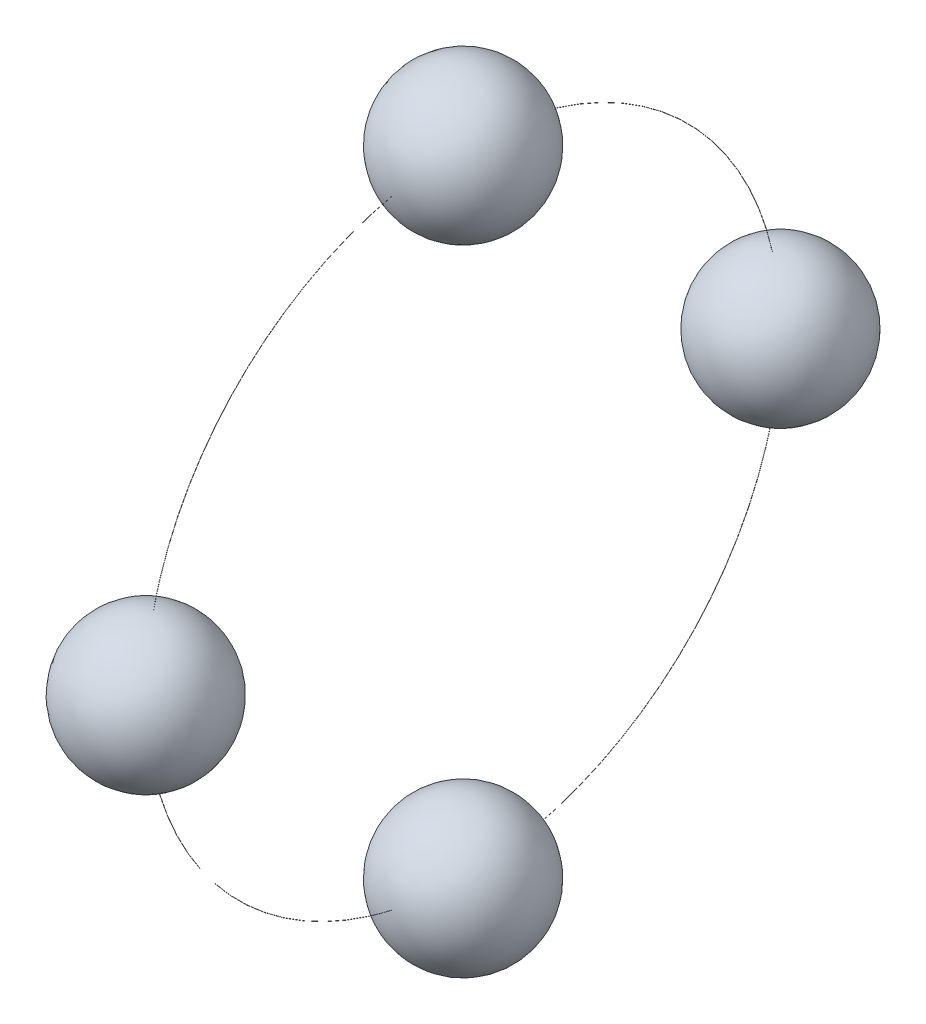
ISO-10303-21;
HEADER;
FILE_DESCRIPTION(('STEP AP214'),'2;1');
FILE_NAME('part.step','',(''),(''),'','','');
FILE_SCHEMA(('AUTOMOTIVE_DESIGN { 1 0 10303 214 1 1 1 1 }'));
ENDSEC;
DATA;
#1=APPLICATION_CONTEXT('core data for automotive mechanical design processes');
#2=APPLICATION_PROTOCOL_DEFINITION('international standard','automotive_design',2000,#1);
#3=PRODUCT_CONTEXT('',#1,'mechanical');
#4=PRODUCT('Part','Part','',(#3));
#5=PRODUCT_RELATED_PRODUCT_CATEGORY('part','',(#4));
#6=PRODUCT_DEFINITION_FORMATION('','',#4);
#7=PRODUCT_DEFINITION_CONTEXT('part definition',#1,'design');
#8=PRODUCT_DEFINITION('design','',#6,#7);
#9=PRODUCT_DEFINITION_SHAPE('','',#8);
#10=(LENGTH_UNIT() NAMED_UNIT(*) SI_UNIT(.MILLI.,.METRE.));
#11=(NAMED_UNIT(*) PLANE_ANGLE_UNIT() SI_UNIT($,.RADIAN.));
#12=(NAMED_UNIT(*) SI_UNIT($,.STERADIAN.) SOLID_ANGLE_UNIT());
#13=UNCERTAINTY_MEASURE_WITH_UNIT(LENGTH_MEASURE(1.E-05),#10,'distance_accuracy_value','');
#14=(GEOMETRIC_REPRESENTATION_CONTEXT(3) GLOBAL_UNCERTAINTY_ASSIGNED_CONTEXT((#13)) GLOBAL_UNIT_ASSIGNED_CONTEXT((#10,
#11,#12)) REPRESENTATION_CONTEXT('',''));
#15=CARTESIAN_POINT('',(0.,0.,0.));
#16=DIRECTION('',(0.,0.,1.));
#17=DIRECTION('',(1.,0.,0.));
#18=AXIS2_PLACEMENT_3D('',#15,#16,#17);
#19=CARTESIAN_POINT('',(1.5,0.,0.));
#20=DIRECTION('',(1.,0.,0.));
#21=DIRECTION('',(0.,-1.,0.));
#22=AXIS2_PLACEMENT_3D('',#19,#20,#21);
#23=TOROIDAL_SURFACE('',#22,3.75,0.001);
#24=CARTESIAN_POINT('',(1.4995848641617,-0.828274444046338,-3.6583173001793));
#25=CARTESIAN_POINT('',(1.49953374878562,-0.828271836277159,-3.658293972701));
#26=CARTESIAN_POINT('',(1.49948458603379,-0.82826874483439,-3.65826631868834));
#27=CARTESIAN_POINT('',(1.49939159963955,-0.828261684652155,-3.65820316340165));
#28=CARTESIAN_POINT('',(1.49934778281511,-0.828257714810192,-3.65816765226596));
#29=CARTESIAN_POINT('',(1.49926679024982,-0.828249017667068,-3.65808985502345));
#30=CARTESIAN_POINT('',(1.49922960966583,-0.828244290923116,-3.65804757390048));
#31=CARTESIAN_POINT('',(1.49916289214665,-0.828234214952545,-3.65795744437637));
#32=CARTESIAN_POINT('',(1.49913335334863,-0.828228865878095,-3.65790959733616));
#33=CARTESIAN_POINT('',(1.49908259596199,-0.828217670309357,-3.65780945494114));
#34=CARTESIAN_POINT('',(1.49906141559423,-0.828211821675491,-3.65775714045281));
#35=CARTESIAN_POINT('',(1.49902814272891,-0.828199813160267,-3.65764972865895));
#36=CARTESIAN_POINT('',(1.49901605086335,-0.828193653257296,-3.65759463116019));
#37=CARTESIAN_POINT('',(1.49900124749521,-0.828181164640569,-3.65748292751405));
#38=CARTESIAN_POINT('',(1.49899858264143,-0.828174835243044,-3.65742631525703));
#39=CARTESIAN_POINT('',(1.4990028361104,-0.828162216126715,-3.6573134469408));
#40=CARTESIAN_POINT('',(1.4990097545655,-0.828155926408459,-3.65725719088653));
#41=CARTESIAN_POINT('',(1.49903300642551,-0.828143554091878,-3.65714653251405));
#42=CARTESIAN_POINT('',(1.49904935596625,-0.828137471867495,-3.65709213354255));
#43=CARTESIAN_POINT('',(1.49909103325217,-0.82812569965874,-3.65698684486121));
#44=CARTESIAN_POINT('',(1.49911636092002,-0.828120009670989,-3.65693595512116));
#45=CARTESIAN_POINT('',(1.49917522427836,-0.828109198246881,-3.6568392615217));
#46=CARTESIAN_POINT('',(1.49920874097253,-0.828104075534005,-3.65679344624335));
#47=CARTESIAN_POINT('',(1.49928307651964,-0.828094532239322,-3.65670809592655));
#48=CARTESIAN_POINT('',(1.49932389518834,-0.828090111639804,-3.65666856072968));
#49=CARTESIAN_POINT('',(1.49941144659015,-0.828082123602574,-3.65659712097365));
#50=CARTESIAN_POINT('',(1.49945814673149,-0.828078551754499,-3.65656517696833));
#51=CARTESIAN_POINT('',(1.49955630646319,-0.828072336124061,-3.65650958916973));
#52=CARTESIAN_POINT('',(1.49960776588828,-0.828069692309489,-3.65648594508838));
#53=CARTESIAN_POINT('',(1.49971365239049,-0.828065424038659,-3.65644777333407));
#54=CARTESIAN_POINT('',(1.49976805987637,-0.828063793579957,-3.65643319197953));
#55=CARTESIAN_POINT('',(1.4998785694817,-0.828061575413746,-3.65641335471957));
#56=CARTESIAN_POINT('',(1.49993467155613,-0.828060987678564,-3.65640809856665));
#57=CARTESIAN_POINT('',(1.50004673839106,-0.828060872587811,-3.65640706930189));
#58=CARTESIAN_POINT('',(1.50010270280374,-0.828061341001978,-3.65641125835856));
#59=CARTESIAN_POINT('',(1.50021312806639,-0.828063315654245,-3.65642891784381));
#60=CARTESIAN_POINT('',(1.50026758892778,-0.828064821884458,-3.65644238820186));
#61=CARTESIAN_POINT('',(1.5003734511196,-0.828068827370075,-3.65647820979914));
#62=CARTESIAN_POINT('',(1.50042485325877,-0.828071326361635,-3.65650055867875));
#63=CARTESIAN_POINT('',(1.50052317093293,-0.828077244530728,-3.65655348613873));
#64=CARTESIAN_POINT('',(1.500570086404,-0.828080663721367,-3.65658406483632));
#65=CARTESIAN_POINT('',(1.50065828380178,-0.828088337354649,-3.65665269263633));
#66=CARTESIAN_POINT('',(1.5006995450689,-0.828092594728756,-3.65669076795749));
#67=CARTESIAN_POINT('',(1.50077509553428,-0.828101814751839,-3.6567732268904));
#68=CARTESIAN_POINT('',(1.50080938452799,-0.828106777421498,-3.65681761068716));
#69=CARTESIAN_POINT('',(1.50087023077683,-0.828117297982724,-3.65691170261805));
#70=CARTESIAN_POINT('',(1.50089674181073,-0.828122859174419,-3.65696144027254));
#71=CARTESIAN_POINT('',(1.50094103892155,-0.828134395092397,-3.65706461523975));
#72=CARTESIAN_POINT('',(1.50095882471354,-0.828140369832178,-3.65711805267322));
#73=CARTESIAN_POINT('',(1.50098526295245,-0.82815259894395,-3.6572274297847));
#74=CARTESIAN_POINT('',(1.50099386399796,-0.828158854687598,-3.65728338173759));
#75=CARTESIAN_POINT('',(1.50100152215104,-0.828171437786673,-3.65739592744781));
#76=CARTESIAN_POINT('',(1.50100057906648,-0.828177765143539,-3.65745252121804));
#77=CARTESIAN_POINT('',(1.50098915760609,-0.828190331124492,-3.65756491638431));
#78=CARTESIAN_POINT('',(1.50097865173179,-0.82819656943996,-3.65762071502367));
#79=CARTESIAN_POINT('',(1.50094835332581,-0.828208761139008,-3.657729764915));
#80=CARTESIAN_POINT('',(1.50092856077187,-0.828214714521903,-3.65778301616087));
#81=CARTESIAN_POINT('',(1.5008802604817,-0.828226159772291,-3.6578853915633));
#82=CARTESIAN_POINT('',(1.50085176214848,-0.828231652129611,-3.65793452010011));
#83=CARTESIAN_POINT('',(1.50078683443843,-0.828242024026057,-3.65802729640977));
#84=CARTESIAN_POINT('',(1.5007504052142,-0.82824690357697,-3.65807094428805));
#85=CARTESIAN_POINT('',(1.50067082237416,-0.828255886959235,-3.65815130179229));
#86=CARTESIAN_POINT('',(1.50062770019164,-0.828259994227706,-3.65818804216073));
#87=CARTESIAN_POINT('',(1.50053583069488,-0.828267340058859,-3.65825375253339));
#88=CARTESIAN_POINT('',(1.5004870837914,-0.828270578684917,-3.65828272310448));
#89=CARTESIAN_POINT('',(1.50038567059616,-0.828276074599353,-3.65833188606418));
#90=CARTESIAN_POINT('',(1.5003330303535,-0.828278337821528,-3.65835213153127));
#91=CARTESIAN_POINT('',(1.50022505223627,-0.828281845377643,-3.65838350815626));
#92=CARTESIAN_POINT('',(1.50016971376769,-0.828283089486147,-3.65839463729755));
#93=CARTESIAN_POINT('',(1.50005819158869,-0.828284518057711,-3.65840741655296));
#94=CARTESIAN_POINT('',(1.50000201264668,-0.828284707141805,-3.6584091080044));
#95=CARTESIAN_POINT('',(1.49989021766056,-0.828284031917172,-3.65840306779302));
#96=CARTESIAN_POINT('',(1.49983460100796,-0.828283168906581,-3.65839534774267));
#97=CARTESIAN_POINT('',(1.49974649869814,-0.828280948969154,-3.65837548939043));
#98=CARTESIAN_POINT('',(1.49971333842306,-0.828279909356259,-3.6583661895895));
#99=CARTESIAN_POINT('',(1.49964816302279,-0.828277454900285,-3.65834423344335));
#100=CARTESIAN_POINT('',(1.49961614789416,-0.828276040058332,-3.65833157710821));
#101=CARTESIAN_POINT('',(1.4995848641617,-0.828274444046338,-3.6583173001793));
#102=B_SPLINE_CURVE_WITH_KNOTS('',3,(#24,#25,#26,#27,#28,#29,#30,#31,#32,#33,#34,#35,#36,#37,
#38,#39,#40,#41,#42,#43,#44,#45,#46,#47,#48,#49,#50,#51,#52,#53,#54,#55,#56,#57,#58,#59,#60,#61,
#62,#63,#64,#65,#66,#67,#68,#69,#70,#71,#72,#73,#74,#75,#76,#77,#78,#79,#80,#81,#82,#83,#84,#85,
#86,#87,#88,#89,#90,#91,#92,#93,#94,#95,#96,#97,#98,#99,#100,#101),.UNSPECIFIED.,.T.,.F.,(4,2,2,
2,2,2,2,2,2,2,2,2,2,2,2,2,2,2,2,2,2,2,2,2,2,2,2,2,2,2,2,2,2,2,2,2,2,2,4),(0.,
0.000168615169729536,0.000337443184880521,0.000506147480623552,0.000674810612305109,
0.000844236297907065,0.00101367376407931,0.00118394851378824,0.00135422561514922,
0.00152479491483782,0.00169536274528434,0.0018655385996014,0.00203571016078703,
0.00220497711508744,0.00237423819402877,0.00254248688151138,0.00271073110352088,
0.00287830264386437,0.00304587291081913,0.00321339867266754,0.00338092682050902,
0.00354905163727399,0.00371718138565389,0.00388629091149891,0.00405540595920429,
0.00422546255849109,0.00439552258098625,0.00456607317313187,0.00473662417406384,
0.00490699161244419,0.00507735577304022,0.0052469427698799,0.00541651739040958,
0.00558504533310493,0.0057536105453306,0.00592143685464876,0.00608905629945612,
0.00619225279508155,0.00629544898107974),.UNSPECIFIED.);
#103=CARTESIAN_POINT('',(1.4995848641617,-0.828274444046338,-3.6583173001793));
#104=VERTEX_POINT('',#103);
#105=EDGE_CURVE('E10',#104,#104,#102,.T.);
#106=ORIENTED_EDGE('',*,*,#105,.F.);
#107=EDGE_LOOP('',(#106));
#108=FACE_BOUND('',#107,.T.);
#109=CARTESIAN_POINT('',(1.4995848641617,-3.6583173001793,-0.828274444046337));
#110=CARTESIAN_POINT('',(1.49963564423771,-3.65834046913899,-0.828277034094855));
#111=CARTESIAN_POINT('',(1.4996884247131,-3.65835940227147,-0.82827915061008));
#112=CARTESIAN_POINT('',(1.49979647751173,-3.65838820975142,-0.828282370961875));
#113=CARTESIAN_POINT('',(1.49985175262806,-3.65839807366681,-0.828283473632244));
#114=CARTESIAN_POINT('',(1.49996316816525,-3.65840842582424,-0.828284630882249));
#115=CARTESIAN_POINT('',(1.50001930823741,-3.65840891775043,-0.828284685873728));
#116=CARTESIAN_POINT('',(1.50013085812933,-3.65840051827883,-0.828283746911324));
#117=CARTESIAN_POINT('',(1.50018626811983,-3.65839162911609,-0.828282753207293));
#118=CARTESIAN_POINT('',(1.50029476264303,-3.6583647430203,-0.828279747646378));
#119=CARTESIAN_POINT('',(1.50034784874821,-3.65834675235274,-0.828277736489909));
#120=CARTESIAN_POINT('',(1.5004502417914,-3.65830219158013,-0.828272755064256));
#121=CARTESIAN_POINT('',(1.50049954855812,-3.65827562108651,-0.828269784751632));
#122=CARTESIAN_POINT('',(1.50059312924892,-3.65821458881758,-0.828262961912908));
#123=CARTESIAN_POINT('',(1.50063738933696,-3.65818010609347,-0.828259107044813));
#124=CARTESIAN_POINT('',(1.50071949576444,-3.6581042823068,-0.828250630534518));
#125=CARTESIAN_POINT('',(1.50075734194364,-3.65806294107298,-0.828246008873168));
#126=CARTESIAN_POINT('',(1.50082577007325,-3.65797433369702,-0.828236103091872));
#127=CARTESIAN_POINT('',(1.50085631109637,-3.65792703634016,-0.828230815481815));
#128=CARTESIAN_POINT('',(1.50090902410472,-3.65782804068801,-0.828219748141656));
#129=CARTESIAN_POINT('',(1.50093119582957,-3.65777634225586,-0.828213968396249));
#130=CARTESIAN_POINT('',(1.5009666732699,-3.65766968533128,-0.828202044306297));
#131=CARTESIAN_POINT('',(1.50097992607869,-3.65761470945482,-0.82819589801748));
#132=CARTESIAN_POINT('',(1.50099699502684,-3.65750332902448,-0.828183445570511));
#133=CARTESIAN_POINT('',(1.50100081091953,-3.6574469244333,-0.828177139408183));
#134=CARTESIAN_POINT('',(1.50099889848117,-3.65733406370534,-0.828164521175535));
#135=CARTESIAN_POINT('',(1.50099313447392,-3.65727760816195,-0.828158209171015));
#136=CARTESIAN_POINT('',(1.50097215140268,-3.65716645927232,-0.828145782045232));
#137=CARTESIAN_POINT('',(1.50095693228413,-3.65711176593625,-0.828139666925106));
#138=CARTESIAN_POINT('',(1.50091745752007,-3.65700570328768,-0.828127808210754));
#139=CARTESIAN_POINT('',(1.50089320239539,-3.65695433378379,-0.828122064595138));
#140=CARTESIAN_POINT('',(1.50083632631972,-3.65685639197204,-0.82811111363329));
#141=CARTESIAN_POINT('',(1.50080370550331,-3.65680981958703,-0.828105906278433));
#142=CARTESIAN_POINT('',(1.50073115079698,-3.65672299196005,-0.828096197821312));
#143=CARTESIAN_POINT('',(1.50069124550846,-3.65668271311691,-0.82809169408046));
#144=CARTESIAN_POINT('',(1.50060516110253,-3.65660943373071,-0.828083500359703));
#145=CARTESIAN_POINT('',(1.50055898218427,-3.65657643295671,-0.828079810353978));
#146=CARTESIAN_POINT('',(1.50046195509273,-3.65651885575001,-0.828073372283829));
#147=CARTESIAN_POINT('',(1.50041113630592,-3.65649423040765,-0.828070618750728));
#148=CARTESIAN_POINT('',(1.50030604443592,-3.65645386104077,-0.828066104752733));
#149=CARTESIAN_POINT('',(1.50025177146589,-3.65643811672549,-0.828064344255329));
#150=CARTESIAN_POINT('',(1.5001416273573,-3.65641603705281,-0.828061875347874));
#151=CARTESIAN_POINT('',(1.50008576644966,-3.65640965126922,-0.828061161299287));
#152=CARTESIAN_POINT('',(1.49997376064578,-3.65640631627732,-0.82806078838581));
#153=CARTESIAN_POINT('',(1.49991761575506,-3.65640936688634,-0.828061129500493));
#154=CARTESIAN_POINT('',(1.49980678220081,-3.65642479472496,-0.828062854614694));
#155=CARTESIAN_POINT('',(1.49975209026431,-3.65643714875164,-0.828064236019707));
#156=CARTESIAN_POINT('',(1.49964556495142,-3.65647079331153,-0.828067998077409));
#157=CARTESIAN_POINT('',(1.49959373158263,-3.65649208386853,-0.82807037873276));
#158=CARTESIAN_POINT('',(1.49949430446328,-3.65654301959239,-0.828076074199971));
#159=CARTESIAN_POINT('',(1.49944671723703,-3.65657267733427,-0.828079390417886));
#160=CARTESIAN_POINT('',(1.49935719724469,-3.65663947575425,-0.828086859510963));
#161=CARTESIAN_POINT('',(1.49931526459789,-3.65667661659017,-0.828091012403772));
#162=CARTESIAN_POINT('',(1.49923802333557,-3.65675751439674,-0.828100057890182));
#163=CARTESIAN_POINT('',(1.49920274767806,-3.65680130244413,-0.828104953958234));
#164=CARTESIAN_POINT('',(1.49914004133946,-3.65689411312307,-0.828115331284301));
#165=CARTESIAN_POINT('',(1.49911261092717,-3.65694313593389,-0.828120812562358));
#166=CARTESIAN_POINT('',(1.4990662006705,-3.6570453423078,-0.828132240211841));
#167=CARTESIAN_POINT('',(1.49904727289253,-3.65709854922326,-0.828138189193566));
#168=CARTESIAN_POINT('',(1.49901862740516,-3.65720735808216,-0.828150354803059));
#169=CARTESIAN_POINT('',(1.49900890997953,-3.65726296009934,-0.828156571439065));
#170=CARTESIAN_POINT('',(1.49899892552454,-3.65737525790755,-0.828169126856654));
#171=CARTESIAN_POINT('',(1.49899870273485,-3.65743195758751,-0.828175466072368));
#172=CARTESIAN_POINT('',(1.49900782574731,-3.65754459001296,-0.828188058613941));
#173=CARTESIAN_POINT('',(1.49901717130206,-3.65760052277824,-0.828194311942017));
#174=CARTESIAN_POINT('',(1.49904519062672,-3.65771009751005,-0.828206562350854));
#175=CARTESIAN_POINT('',(1.49906387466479,-3.65776373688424,-0.828212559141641));
#176=CARTESIAN_POINT('',(1.49911006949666,-3.65786713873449,-0.828224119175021));
#177=CARTESIAN_POINT('',(1.49913758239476,-3.65791690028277,-0.828229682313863));
#178=CARTESIAN_POINT('',(1.49920058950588,-3.65801098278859,-0.828240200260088));
#179=CARTESIAN_POINT('',(1.49923606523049,-3.65805531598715,-0.828245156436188));
#180=CARTESIAN_POINT('',(1.49931401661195,-3.65813734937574,-0.828254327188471));
#181=CARTESIAN_POINT('',(1.4993564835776,-3.65817505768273,-0.828258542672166));
#182=CARTESIAN_POINT('',(1.49943027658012,-3.65823014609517,-0.828264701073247));
#183=CARTESIAN_POINT('',(1.49945986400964,-3.65824986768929,-0.828266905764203));
#184=CARTESIAN_POINT('',(1.49952098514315,-3.65828606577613,-0.828270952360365));
#185=CARTESIAN_POINT('',(1.49955251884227,-3.65830254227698,-0.828272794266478));
#186=CARTESIAN_POINT('',(1.4995848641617,-3.6583173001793,-0.828274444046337));
#187=B_SPLINE_CURVE_WITH_KNOTS('',3,(#109,#110,#111,#112,#113,#114,#115,#116,#117,#118,#119,
#120,#121,#122,#123,#124,#125,#126,#127,#128,#129,#130,#131,#132,#133,#134,#135,#136,#137,#138,
#139,#140,#141,#142,#143,#144,#145,#146,#147,#148,#149,#150,#151,#152,#153,#154,#155,#156,#157,
#158,#159,#160,#161,#162,#163,#164,#165,#166,#167,#168,#169,#170,#171,#172,#173,#174,#175,#176,
#177,#178,#179,#180,#181,#182,#183,#184,#185,#186),.UNSPECIFIED.,.T.,.F.,(4,2,2,2,2,2,2,2,2,2,2,
2,2,2,2,2,2,2,2,2,2,2,2,2,2,2,2,2,2,2,2,2,2,2,2,2,2,2,4),(0.,0.000167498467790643,
0.000335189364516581,0.000502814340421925,0.000670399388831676,0.000837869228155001,
0.00100534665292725,0.00117327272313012,0.00134120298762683,0.00151005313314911,
0.00167890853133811,0.00184875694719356,0.00201860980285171,0.00218909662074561,
0.0023595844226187,0.00253006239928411,0.00270053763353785,0.00287035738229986,
0.00304017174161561,0.00320897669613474,0.00337777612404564,0.00354566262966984,
0.00371354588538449,0.00388101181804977,0.00404847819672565,0.0042161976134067,
0.0043839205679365,0.00455245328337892,0.00472099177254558,0.00489054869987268,
0.00506011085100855,0.00523046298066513,0.00540081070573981,0.00557134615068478,
0.00574192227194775,0.00591210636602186,0.00608208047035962,0.0061887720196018,
0.00629546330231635),.UNSPECIFIED.);
#188=CARTESIAN_POINT('',(1.4995848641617,-3.6583173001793,-0.828274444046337));
#189=VERTEX_POINT('',#188);
#190=EDGE_CURVE('E35',#189,#189,#187,.T.);
#191=ORIENTED_EDGE('',*,*,#190,.F.);
#192=EDGE_LOOP('',(#191));
#193=FACE_BOUND('',#192,.T.);
#194=ADVANCED_FACE('F14',(#108,#193),#23,.T.);
#195=CARTESIAN_POINT('',(1.4995848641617,0.828274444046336,-3.6583173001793));
#196=CARTESIAN_POINT('',(1.49963564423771,0.828277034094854,-3.65834046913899));
#197=CARTESIAN_POINT('',(1.4996884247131,0.82827915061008,-3.65835940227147));
#198=CARTESIAN_POINT('',(1.49979647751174,0.828282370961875,-3.65838820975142));
#199=CARTESIAN_POINT('',(1.49985175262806,0.828283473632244,-3.65839807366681));
#200=CARTESIAN_POINT('',(1.49996316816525,0.828284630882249,-3.65840842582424));
#201=CARTESIAN_POINT('',(1.50001930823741,0.828284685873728,-3.65840891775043));
#202=CARTESIAN_POINT('',(1.50013085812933,0.828283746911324,-3.65840051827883));
#203=CARTESIAN_POINT('',(1.50018626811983,0.828282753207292,-3.65839162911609));
#204=CARTESIAN_POINT('',(1.50029476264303,0.828279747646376,-3.6583647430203));
#205=CARTESIAN_POINT('',(1.50034784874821,0.828277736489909,-3.65834675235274));
#206=CARTESIAN_POINT('',(1.5004502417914,0.828272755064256,-3.65830219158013));
#207=CARTESIAN_POINT('',(1.50049954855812,0.828269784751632,-3.65827562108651));
#208=CARTESIAN_POINT('',(1.50059312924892,0.828262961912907,-3.65821458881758));
#209=CARTESIAN_POINT('',(1.50063738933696,0.828259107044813,-3.65818010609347));
#210=CARTESIAN_POINT('',(1.50071949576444,0.828250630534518,-3.6581042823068));
#211=CARTESIAN_POINT('',(1.50075734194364,0.828246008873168,-3.65806294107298));
#212=CARTESIAN_POINT('',(1.50082577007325,0.828236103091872,-3.65797433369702));
#213=CARTESIAN_POINT('',(1.50085631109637,0.828230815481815,-3.65792703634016));
#214=CARTESIAN_POINT('',(1.50090902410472,0.828219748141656,-3.65782804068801));
#215=CARTESIAN_POINT('',(1.50093119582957,0.828213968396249,-3.65777634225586));
#216=CARTESIAN_POINT('',(1.5009666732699,0.828202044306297,-3.65766968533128));
#217=CARTESIAN_POINT('',(1.50097992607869,0.82819589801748,-3.65761470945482));
#218=CARTESIAN_POINT('',(1.50099699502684,0.82818344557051,-3.65750332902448));
#219=CARTESIAN_POINT('',(1.50100081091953,0.828177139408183,-3.65744692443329));
#220=CARTESIAN_POINT('',(1.50099889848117,0.828164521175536,-3.65733406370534));
#221=CARTESIAN_POINT('',(1.50099313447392,0.828158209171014,-3.65727760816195));
#222=CARTESIAN_POINT('',(1.50097215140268,0.828145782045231,-3.65716645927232));
#223=CARTESIAN_POINT('',(1.50095693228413,0.828139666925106,-3.65711176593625));
#224=CARTESIAN_POINT('',(1.50091745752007,0.828127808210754,-3.65700570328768));
#225=CARTESIAN_POINT('',(1.50089320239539,0.828122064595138,-3.65695433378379));
#226=CARTESIAN_POINT('',(1.50083632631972,0.828111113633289,-3.65685639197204));
#227=CARTESIAN_POINT('',(1.50080370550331,0.828105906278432,-3.65680981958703));
#228=CARTESIAN_POINT('',(1.50073115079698,0.828096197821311,-3.65672299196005));
#229=CARTESIAN_POINT('',(1.50069124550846,0.828091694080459,-3.65668271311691));
#230=CARTESIAN_POINT('',(1.50060516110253,0.828083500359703,-3.65660943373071));
#231=CARTESIAN_POINT('',(1.50055898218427,0.828079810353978,-3.65657643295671));
#232=CARTESIAN_POINT('',(1.50046195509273,0.828073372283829,-3.65651885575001));
#233=CARTESIAN_POINT('',(1.50041113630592,0.828070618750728,-3.65649423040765));
#234=CARTESIAN_POINT('',(1.50030604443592,0.828066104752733,-3.65645386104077));
#235=CARTESIAN_POINT('',(1.50025177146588,0.828064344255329,-3.65643811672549));
#236=CARTESIAN_POINT('',(1.5001416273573,0.828061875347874,-3.65641603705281));
#237=CARTESIAN_POINT('',(1.50008576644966,0.828061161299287,-3.65640965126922));
#238=CARTESIAN_POINT('',(1.49997376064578,0.828060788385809,-3.65640631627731));
#239=CARTESIAN_POINT('',(1.49991761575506,0.828061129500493,-3.65640936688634));
#240=CARTESIAN_POINT('',(1.49980678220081,0.828062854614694,-3.65642479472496));
#241=CARTESIAN_POINT('',(1.49975209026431,0.828064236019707,-3.65643714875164));
#242=CARTESIAN_POINT('',(1.49964556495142,0.828067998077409,-3.65647079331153));
#243=CARTESIAN_POINT('',(1.49959373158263,0.82807037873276,-3.65649208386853));
#244=CARTESIAN_POINT('',(1.49949430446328,0.828076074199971,-3.65654301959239));
#245=CARTESIAN_POINT('',(1.49944671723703,0.828079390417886,-3.65657267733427));
#246=CARTESIAN_POINT('',(1.49935719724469,0.828086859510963,-3.65663947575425));
#247=CARTESIAN_POINT('',(1.49931526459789,0.828091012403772,-3.65667661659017));
#248=CARTESIAN_POINT('',(1.49923802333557,0.828100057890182,-3.65675751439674));
#249=CARTESIAN_POINT('',(1.49920274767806,0.828104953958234,-3.65680130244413));
#250=CARTESIAN_POINT('',(1.49914004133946,0.828115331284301,-3.65689411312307));
#251=CARTESIAN_POINT('',(1.49911261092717,0.828120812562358,-3.65694313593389));
#252=CARTESIAN_POINT('',(1.4990662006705,0.828132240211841,-3.6570453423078));
#253=CARTESIAN_POINT('',(1.49904727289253,0.828138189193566,-3.65709854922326));
#254=CARTESIAN_POINT('',(1.49901862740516,0.828150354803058,-3.65720735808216));
#255=CARTESIAN_POINT('',(1.49900890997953,0.828156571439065,-3.65726296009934));
#256=CARTESIAN_POINT('',(1.49899892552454,0.828169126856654,-3.65737525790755));
#257=CARTESIAN_POINT('',(1.49899870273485,0.828175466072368,-3.65743195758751));
#258=CARTESIAN_POINT('',(1.49900782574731,0.828188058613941,-3.65754459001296));
#259=CARTESIAN_POINT('',(1.49901717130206,0.828194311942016,-3.65760052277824));
#260=CARTESIAN_POINT('',(1.49904519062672,0.828206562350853,-3.65771009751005));
#261=CARTESIAN_POINT('',(1.49906387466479,0.828212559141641,-3.65776373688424));
#262=CARTESIAN_POINT('',(1.49911006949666,0.828224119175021,-3.65786713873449));
#263=CARTESIAN_POINT('',(1.49913758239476,0.828229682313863,-3.65791690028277));
#264=CARTESIAN_POINT('',(1.49920058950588,0.828240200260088,-3.65801098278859));
#265=CARTESIAN_POINT('',(1.49923606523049,0.828245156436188,-3.65805531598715));
#266=CARTESIAN_POINT('',(1.49931401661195,0.828254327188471,-3.65813734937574));
#267=CARTESIAN_POINT('',(1.4993564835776,0.828258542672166,-3.65817505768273));
#268=CARTESIAN_POINT('',(1.49943027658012,0.828264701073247,-3.65823014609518));
#269=CARTESIAN_POINT('',(1.49945986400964,0.828266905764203,-3.65824986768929));
#270=CARTESIAN_POINT('',(1.49952098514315,0.828270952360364,-3.65828606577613));
#271=CARTESIAN_POINT('',(1.49955251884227,0.828272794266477,-3.65830254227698));
#272=CARTESIAN_POINT('',(1.4995848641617,0.828274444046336,-3.6583173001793));
#273=B_SPLINE_CURVE_WITH_KNOTS('',3,(#195,#196,#197,#198,#199,#200,#201,#202,#203,#204,#205,
#206,#207,#208,#209,#210,#211,#212,#213,#214,#215,#216,#217,#218,#219,#220,#221,#222,#223,#224,
#225,#226,#227,#228,#229,#230,#231,#232,#233,#234,#235,#236,#237,#238,#239,#240,#241,#242,#243,
#244,#245,#246,#247,#248,#249,#250,#251,#252,#253,#254,#255,#256,#257,#258,#259,#260,#261,#262,
#263,#264,#265,#266,#267,#268,#269,#270,#271,#272),.UNSPECIFIED.,.T.,.F.,(4,2,2,2,2,2,2,2,2,2,2,
2,2,2,2,2,2,2,2,2,2,2,2,2,2,2,2,2,2,2,2,2,2,2,2,2,2,2,4),(0.,0.00016749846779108,
0.000335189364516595,0.000502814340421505,0.0006703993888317,0.000837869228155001,
0.00100534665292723,0.00117327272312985,0.00134120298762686,0.00151005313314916,
0.00167890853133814,0.00184875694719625,0.0020186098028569,0.00218909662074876,
0.00235958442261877,0.00253006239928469,0.00270053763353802,0.00287035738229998,
0.00304017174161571,0.00320897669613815,0.00337777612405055,0.00354566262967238,
0.00371354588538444,0.00388101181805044,0.00404847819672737,0.00421619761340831,
0.00438392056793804,0.00455245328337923,0.0047209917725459,0.00489054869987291,
0.00506011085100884,0.00523046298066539,0.00540081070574,0.00557134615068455,
0.00574192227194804,0.00591210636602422,0.006082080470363,0.00618877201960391,
0.00629546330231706),.UNSPECIFIED.);
#274=CARTESIAN_POINT('',(1.4995848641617,0.828274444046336,-3.6583173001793));
#275=VERTEX_POINT('',#274);
#276=EDGE_CURVE('E26',#275,#275,#273,.T.);
#277=ORIENTED_EDGE('',*,*,#276,.F.);
#278=EDGE_LOOP('',(#277));
#279=FACE_BOUND('',#278,.T.);
#280=CARTESIAN_POINT('',(1.49964915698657,3.65647110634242,-0.828068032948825));
#281=CARTESIAN_POINT('',(1.49970142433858,3.65645152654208,-0.828065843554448));
#282=CARTESIAN_POINT('',(1.49975539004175,3.65643631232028,-0.828064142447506));
#283=CARTESIAN_POINT('',(1.49986516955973,3.65641509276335,-0.828061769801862));
#284=CARTESIAN_POINT('',(1.49992098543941,3.65640909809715,-0.82806109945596));
#285=CARTESIAN_POINT('',(1.50003281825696,3.65640651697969,-0.828060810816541));
#286=CARTESIAN_POINT('',(1.5000888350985,3.65640992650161,-0.828061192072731));
#287=CARTESIAN_POINT('',(1.50019948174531,3.65642604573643,-0.828062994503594));
#288=CARTESIAN_POINT('',(1.50025411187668,3.65643875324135,-0.828064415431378));
#289=CARTESIAN_POINT('',(1.5003604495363,3.65647309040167,-0.828068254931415));
#290=CARTESIAN_POINT('',(1.50041215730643,3.65649471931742,-0.828070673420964));
#291=CARTESIAN_POINT('',(1.50051120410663,3.65654626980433,-0.82807643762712));
#292=CARTESIAN_POINT('',(1.50055854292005,3.65657619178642,-0.828079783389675));
#293=CARTESIAN_POINT('',(1.50064768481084,3.65664357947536,-0.828087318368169));
#294=CARTESIAN_POINT('',(1.50068946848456,3.65668107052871,-0.828091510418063));
#295=CARTESIAN_POINT('',(1.50076615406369,3.65676245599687,-0.828100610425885));
#296=CARTESIAN_POINT('',(1.50080105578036,3.65680635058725,-0.828105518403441));
#297=CARTESIAN_POINT('',(1.5008632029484,3.65689956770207,-0.828115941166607));
#298=CARTESIAN_POINT('',(1.50089040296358,3.6569489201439,-0.828121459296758));
#299=CARTESIAN_POINT('',(1.50093613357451,3.65705144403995,-0.828132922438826));
#300=CARTESIAN_POINT('',(1.50095466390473,3.65710461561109,-0.828138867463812));
#301=CARTESIAN_POINT('',(1.50098263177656,3.65721359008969,-0.8281510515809));
#302=CARTESIAN_POINT('',(1.50099201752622,3.65726940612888,-0.828157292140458));
#303=CARTESIAN_POINT('',(1.50100125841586,3.65738181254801,-0.828169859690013));
#304=CARTESIAN_POINT('',(1.5010011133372,3.6574384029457,-0.82817618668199));
#305=CARTESIAN_POINT('',(1.5009912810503,3.65755093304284,-0.828188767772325));
#306=CARTESIAN_POINT('',(1.50098156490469,3.65760687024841,-0.828195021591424));
#307=CARTESIAN_POINT('',(1.50095281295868,3.65771632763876,-0.8282072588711));
#308=CARTESIAN_POINT('',(1.50093377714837,3.65776984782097,-0.828213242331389));
#309=CARTESIAN_POINT('',(1.50088693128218,3.65787289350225,-0.828224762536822));
#310=CARTESIAN_POINT('',(1.50085912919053,3.65792242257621,-0.828230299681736));
#311=CARTESIAN_POINT('',(1.50079551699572,3.65801611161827,-0.828240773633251));
#312=CARTESIAN_POINT('',(1.50075970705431,3.65806027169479,-0.828245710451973));
#313=CARTESIAN_POINT('',(1.50068126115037,3.65814175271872,-0.828254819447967));
#314=CARTESIAN_POINT('',(1.50063865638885,3.65817910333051,-0.828258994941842));
#315=CARTESIAN_POINT('',(1.50054770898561,3.65824611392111,-0.828266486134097));
#316=CARTESIAN_POINT('',(1.5004993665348,3.65827577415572,-0.828269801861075));
#317=CARTESIAN_POINT('',(1.5003986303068,3.65832637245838,-0.828275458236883));
#318=CARTESIAN_POINT('',(1.50034626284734,3.65834736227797,-0.828277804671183));
#319=CARTESIAN_POINT('',(1.50023871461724,3.65838025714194,-0.828281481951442));
#320=CARTESIAN_POINT('',(1.5001835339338,3.6583921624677,-0.828282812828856));
#321=CARTESIAN_POINT('',(1.50007221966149,3.6584064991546,-0.828284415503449));
#322=CARTESIAN_POINT('',(1.50001609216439,3.65840897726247,-0.828284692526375));
#323=CARTESIAN_POINT('',(1.49990421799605,3.65840451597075,-0.828284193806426));
#324=CARTESIAN_POINT('',(1.49984847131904,3.65839757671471,-0.828283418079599));
#325=CARTESIAN_POINT('',(1.49973903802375,3.65837450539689,-0.828280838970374));
#326=CARTESIAN_POINT('',(1.49968534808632,3.65835838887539,-0.82827903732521));
#327=CARTESIAN_POINT('',(1.49958144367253,3.65831744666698,-0.828274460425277));
#328=CARTESIAN_POINT('',(1.49953122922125,3.65829262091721,-0.82827168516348));
#329=CARTESIAN_POINT('',(1.49943557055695,3.65823491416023,-0.828265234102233));
#330=CARTESIAN_POINT('',(1.49939013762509,3.65820201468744,-0.828261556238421));
#331=CARTESIAN_POINT('',(1.4993054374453,3.65812913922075,-0.828253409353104));
#332=CARTESIAN_POINT('',(1.49926617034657,3.65808916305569,-0.828248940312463));
#333=CARTESIAN_POINT('',(1.49919469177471,3.65800304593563,-0.828239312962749));
#334=CARTESIAN_POINT('',(1.4991625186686,3.65795687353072,-0.828234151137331));
#335=CARTESIAN_POINT('',(1.49910637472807,3.65785984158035,-0.828223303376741));
#336=CARTESIAN_POINT('',(1.49908240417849,3.65780898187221,-0.828217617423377));
#337=CARTESIAN_POINT('',(1.49904319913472,3.65770369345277,-0.828205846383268));
#338=CARTESIAN_POINT('',(1.49902801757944,3.65764924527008,-0.828199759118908));
#339=CARTESIAN_POINT('',(1.49900702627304,3.6575385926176,-0.82818738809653));
#340=CARTESIAN_POINT('',(1.49900121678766,3.65748238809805,-0.828181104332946));
#341=CARTESIAN_POINT('',(1.4989991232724,3.65736957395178,-0.828168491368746));
#342=CARTESIAN_POINT('',(1.49900287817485,3.65731296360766,-0.828162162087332));
#343=CARTESIAN_POINT('',(1.49901989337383,3.65720117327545,-0.828149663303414));
#344=CARTESIAN_POINT('',(1.49903315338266,3.65714599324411,-0.828143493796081));
#345=CARTESIAN_POINT('',(1.49906881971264,3.65703861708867,-0.828131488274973));
#346=CARTESIAN_POINT('',(1.49909122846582,3.65698642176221,-0.828125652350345));
#347=CARTESIAN_POINT('',(1.49914458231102,3.65688651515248,-0.828114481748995));
#348=CARTESIAN_POINT('',(1.49917552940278,3.65683880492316,-0.828109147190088));
#349=CARTESIAN_POINT('',(1.49924498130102,3.6567494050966,-0.828099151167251));
#350=CARTESIAN_POINT('',(1.49928346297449,3.65670769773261,-0.828094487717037));
#351=CARTESIAN_POINT('',(1.49936693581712,3.65663138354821,-0.828085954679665));
#352=CARTESIAN_POINT('',(1.49941191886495,3.65659676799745,-0.828082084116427));
#353=CARTESIAN_POINT('',(1.49948928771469,3.65654705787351,-0.828076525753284));
#354=CARTESIAN_POINT('',(1.49952010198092,3.65652950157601,-0.8280745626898));
#355=CARTESIAN_POINT('',(1.49958343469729,3.65649774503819,-0.828071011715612));
#356=CARTESIAN_POINT('',(1.49961595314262,3.65648354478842,-0.828069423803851));
#357=CARTESIAN_POINT('',(1.49964915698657,3.65647110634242,-0.828068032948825));
#358=B_SPLINE_CURVE_WITH_KNOTS('',3,(#280,#281,#282,#283,#284,#285,#286,#287,#288,#289,#290,
#291,#292,#293,#294,#295,#296,#297,#298,#299,#300,#301,#302,#303,#304,#305,#306,#307,#308,#309,
#310,#311,#312,#313,#314,#315,#316,#317,#318,#319,#320,#321,#322,#323,#324,#325,#326,#327,#328,
#329,#330,#331,#332,#333,#334,#335,#336,#337,#338,#339,#340,#341,#342,#343,#344,#345,#346,#347,
#348,#349,#350,#351,#352,#353,#354,#355,#356,#357),.UNSPECIFIED.,.T.,.F.,(4,2,2,2,2,2,2,2,2,2,2,
2,2,2,2,2,2,2,2,2,2,2,2,2,2,2,2,2,2,2,2,2,2,2,2,2,2,2,4),(0.,0.000167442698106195,
0.000335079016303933,0.000502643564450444,0.000670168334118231,0.000837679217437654,
0.00100519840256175,0.00117328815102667,0.00134138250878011,0.00151044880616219,
0.00167952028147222,0.00184954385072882,0.00201957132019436,0.00219011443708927,
0.00236065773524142,0.00253104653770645,0.00270143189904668,0.00287105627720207,
0.00304067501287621,0.00320926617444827,0.00337785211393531,0.00354560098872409,
0.00371334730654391,0.00388081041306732,0.00404827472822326,0.00421612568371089,
0.00438398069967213,0.00455272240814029,0.00472146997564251,0.00489122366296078,
0.00506098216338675,0.00523143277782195,0.00540187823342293,0.00557236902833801,
0.00574289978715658,0.00591291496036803,0.00608271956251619,0.00618909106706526,
0.00629546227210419),.UNSPECIFIED.);
#359=CARTESIAN_POINT('',(1.49964915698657,3.65647110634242,-0.828068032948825));
#360=VERTEX_POINT('',#359);
#361=EDGE_CURVE('E79',#360,#360,#358,.T.);
#362=ORIENTED_EDGE('',*,*,#361,.F.);
#363=EDGE_LOOP('',(#362));
#364=FACE_BOUND('',#363,.T.);
#365=ADVANCED_FACE('F102',(#279,#364),#23,.T.);
#366=CARTESIAN_POINT('',(1.4995848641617,-3.6583173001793,0.828274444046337));
#367=CARTESIAN_POINT('',(1.49953374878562,-3.658293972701,0.828271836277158));
#368=CARTESIAN_POINT('',(1.49948458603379,-3.65826631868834,0.828268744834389));
#369=CARTESIAN_POINT('',(1.49939159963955,-3.65820316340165,0.828261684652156));
#370=CARTESIAN_POINT('',(1.49934778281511,-3.65816765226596,0.828257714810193));
#371=CARTESIAN_POINT('',(1.49926679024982,-3.65808985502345,0.828249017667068));
#372=CARTESIAN_POINT('',(1.49922960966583,-3.65804757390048,0.828244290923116));
#373=CARTESIAN_POINT('',(1.49916289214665,-3.65795744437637,0.828234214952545));
#374=CARTESIAN_POINT('',(1.49913335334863,-3.65790959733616,0.828228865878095));
#375=CARTESIAN_POINT('',(1.49908259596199,-3.65780945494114,0.828217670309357));
#376=CARTESIAN_POINT('',(1.49906141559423,-3.6577571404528,0.828211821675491));
#377=CARTESIAN_POINT('',(1.4990281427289,-3.65764972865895,0.828199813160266));
#378=CARTESIAN_POINT('',(1.49901605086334,-3.65759463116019,0.828193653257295));
#379=CARTESIAN_POINT('',(1.49900124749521,-3.65748292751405,0.828181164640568));
#380=CARTESIAN_POINT('',(1.49899858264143,-3.65742631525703,0.828174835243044));
#381=CARTESIAN_POINT('',(1.4990028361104,-3.6573134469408,0.828162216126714));
#382=CARTESIAN_POINT('',(1.4990097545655,-3.65725719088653,0.828155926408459));
#383=CARTESIAN_POINT('',(1.49903300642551,-3.65714653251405,0.828143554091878));
#384=CARTESIAN_POINT('',(1.49904935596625,-3.65709213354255,0.828137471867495));
#385=CARTESIAN_POINT('',(1.49909103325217,-3.65698684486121,0.828125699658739));
#386=CARTESIAN_POINT('',(1.49911636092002,-3.65693595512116,0.828120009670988));
#387=CARTESIAN_POINT('',(1.49917522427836,-3.6568392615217,0.82810919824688));
#388=CARTESIAN_POINT('',(1.49920874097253,-3.65679344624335,0.828104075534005));
#389=CARTESIAN_POINT('',(1.49928307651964,-3.65670809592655,0.828094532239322));
#390=CARTESIAN_POINT('',(1.49932389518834,-3.65666856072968,0.828090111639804));
#391=CARTESIAN_POINT('',(1.49941144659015,-3.65659712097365,0.828082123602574));
#392=CARTESIAN_POINT('',(1.49945814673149,-3.65656517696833,0.828078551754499));
#393=CARTESIAN_POINT('',(1.49955630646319,-3.65650958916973,0.828072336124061));
#394=CARTESIAN_POINT('',(1.49960776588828,-3.65648594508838,0.828069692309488));
#395=CARTESIAN_POINT('',(1.49971365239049,-3.65644777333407,0.828065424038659));
#396=CARTESIAN_POINT('',(1.49976805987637,-3.65643319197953,0.828063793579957));
#397=CARTESIAN_POINT('',(1.4998785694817,-3.65641335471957,0.828061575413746));
#398=CARTESIAN_POINT('',(1.49993467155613,-3.65640809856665,0.828060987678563));
#399=CARTESIAN_POINT('',(1.50004673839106,-3.65640706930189,0.82806087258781));
#400=CARTESIAN_POINT('',(1.50010270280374,-3.65641125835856,0.828061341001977));
#401=CARTESIAN_POINT('',(1.50021312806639,-3.65642891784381,0.828063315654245));
#402=CARTESIAN_POINT('',(1.50026758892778,-3.65644238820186,0.828064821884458));
#403=CARTESIAN_POINT('',(1.5003734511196,-3.65647820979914,0.828068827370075));
#404=CARTESIAN_POINT('',(1.50042485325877,-3.65650055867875,0.828071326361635));
#405=CARTESIAN_POINT('',(1.50052317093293,-3.65655348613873,0.828077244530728));
#406=CARTESIAN_POINT('',(1.500570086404,-3.65658406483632,0.828080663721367));
#407=CARTESIAN_POINT('',(1.50065828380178,-3.65665269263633,0.828088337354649));
#408=CARTESIAN_POINT('',(1.5006995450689,-3.65669076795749,0.828092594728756));
#409=CARTESIAN_POINT('',(1.50077509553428,-3.6567732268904,0.828101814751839));
#410=CARTESIAN_POINT('',(1.50080938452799,-3.65681761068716,0.828106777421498));
#411=CARTESIAN_POINT('',(1.50087023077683,-3.65691170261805,0.828117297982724));
#412=CARTESIAN_POINT('',(1.50089674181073,-3.65696144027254,0.828122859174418));
#413=CARTESIAN_POINT('',(1.50094103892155,-3.65706461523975,0.828134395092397));
#414=CARTESIAN_POINT('',(1.50095882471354,-3.65711805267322,0.828140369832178));
#415=CARTESIAN_POINT('',(1.50098526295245,-3.6572274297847,0.82815259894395));
#416=CARTESIAN_POINT('',(1.50099386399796,-3.65728338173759,0.828158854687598));
#417=CARTESIAN_POINT('',(1.50100152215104,-3.65739592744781,0.828171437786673));
#418=CARTESIAN_POINT('',(1.50100057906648,-3.65745252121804,0.828177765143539));
#419=CARTESIAN_POINT('',(1.50098915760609,-3.65756491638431,0.828190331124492));
#420=CARTESIAN_POINT('',(1.50097865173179,-3.65762071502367,0.82819656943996));
#421=CARTESIAN_POINT('',(1.50094835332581,-3.657729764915,0.828208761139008));
#422=CARTESIAN_POINT('',(1.50092856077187,-3.65778301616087,0.828214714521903));
#423=CARTESIAN_POINT('',(1.5008802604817,-3.6578853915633,0.828226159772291));
#424=CARTESIAN_POINT('',(1.50085176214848,-3.65793452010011,0.828231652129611));
#425=CARTESIAN_POINT('',(1.50078683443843,-3.65802729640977,0.828242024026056));
#426=CARTESIAN_POINT('',(1.5007504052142,-3.65807094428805,0.82824690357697));
#427=CARTESIAN_POINT('',(1.50067082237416,-3.65815130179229,0.828255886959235));
#428=CARTESIAN_POINT('',(1.50062770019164,-3.65818804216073,0.828259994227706));
#429=CARTESIAN_POINT('',(1.50053583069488,-3.65825375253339,0.828267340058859));
#430=CARTESIAN_POINT('',(1.5004870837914,-3.65828272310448,0.828270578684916));
#431=CARTESIAN_POINT('',(1.50038567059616,-3.65833188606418,0.828276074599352));
#432=CARTESIAN_POINT('',(1.5003330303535,-3.65835213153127,0.828278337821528));
#433=CARTESIAN_POINT('',(1.50022505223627,-3.65838350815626,0.828281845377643));
#434=CARTESIAN_POINT('',(1.50016971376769,-3.65839463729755,0.828283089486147));
#435=CARTESIAN_POINT('',(1.50005819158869,-3.65840741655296,0.828284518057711));
#436=CARTESIAN_POINT('',(1.50000201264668,-3.6584091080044,0.828284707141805));
#437=CARTESIAN_POINT('',(1.49989021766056,-3.65840306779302,0.828284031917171));
#438=CARTESIAN_POINT('',(1.49983460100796,-3.65839534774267,0.82828316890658));
#439=CARTESIAN_POINT('',(1.49974649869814,-3.65837548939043,0.828280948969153));
#440=CARTESIAN_POINT('',(1.49971333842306,-3.6583661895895,0.828279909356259));
#441=CARTESIAN_POINT('',(1.49964816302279,-3.65834423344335,0.828277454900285));
#442=CARTESIAN_POINT('',(1.49961614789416,-3.65833157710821,0.828276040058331));
#443=CARTESIAN_POINT('',(1.4995848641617,-3.6583173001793,0.828274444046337));
#444=B_SPLINE_CURVE_WITH_KNOTS('',3,(#366,#367,#368,#369,#370,#371,#372,#373,#374,#375,#376,
#377,#378,#379,#380,#381,#382,#383,#384,#385,#386,#387,#388,#389,#390,#391,#392,#393,#394,#395,
#396,#397,#398,#399,#400,#401,#402,#403,#404,#405,#406,#407,#408,#409,#410,#411,#412,#413,#414,
#415,#416,#417,#418,#419,#420,#421,#422,#423,#424,#425,#426,#427,#428,#429,#430,#431,#432,#433,
#434,#435,#436,#437,#438,#439,#440,#441,#442,#443),.UNSPECIFIED.,.T.,.F.,(4,2,2,2,2,2,2,2,2,2,2,
2,2,2,2,2,2,2,2,2,2,2,2,2,2,2,2,2,2,2,2,2,2,2,2,2,2,2,4),(0.,0.000168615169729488,
0.000337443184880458,0.000506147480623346,0.000674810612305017,0.000844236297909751,
0.00101367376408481,0.00118394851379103,0.00135422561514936,0.00152479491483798,
0.00169536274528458,0.00186553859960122,0.00203571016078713,0.00220497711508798,
0.00237423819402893,0.00254248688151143,0.00271073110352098,0.00287830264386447,
0.00304587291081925,0.00321339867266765,0.00338092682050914,0.0035490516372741,
0.003717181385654,0.00388629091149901,0.0040554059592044,0.00422546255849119,
0.00439552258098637,0.00456607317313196,0.00473662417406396,0.00490699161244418,
0.00507735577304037,0.00524694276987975,0.00541651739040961,0.00558504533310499,
0.00575361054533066,0.00592143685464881,0.00608905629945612,0.00619225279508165,
0.00629544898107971),.UNSPECIFIED.);
#445=CARTESIAN_POINT('',(1.4995848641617,-3.6583173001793,0.828274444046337));
#446=VERTEX_POINT('',#445);
#447=EDGE_CURVE('E42',#446,#446,#444,.T.);
#448=ORIENTED_EDGE('',*,*,#447,.F.);
#449=EDGE_LOOP('',(#448));
#450=FACE_BOUND('',#449,.T.);
#451=CARTESIAN_POINT('',(1.49964915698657,-0.828068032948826,3.65647110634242));
#452=CARTESIAN_POINT('',(1.49959658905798,-0.828070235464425,3.65649080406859));
#453=CARTESIAN_POINT('',(1.49954566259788,-0.828072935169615,3.65651494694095));
#454=CARTESIAN_POINT('',(1.49944857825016,-0.828079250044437,3.65657142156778));
#455=CARTESIAN_POINT('',(1.49940242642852,-0.828082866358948,3.65660376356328));
#456=CARTESIAN_POINT('',(1.49931626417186,-0.828090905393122,3.65667565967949));
#457=CARTESIAN_POINT('',(1.49927624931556,-0.828095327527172,3.65671520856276));
#458=CARTESIAN_POINT('',(1.49920344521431,-0.82810485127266,3.65680038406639));
#459=CARTESIAN_POINT('',(1.49917065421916,-0.828109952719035,3.65684600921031));
#460=CARTESIAN_POINT('',(1.49911305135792,-0.828120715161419,3.65694226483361));
#461=CARTESIAN_POINT('',(1.49908827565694,-0.82812637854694,3.65699291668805));
#462=CARTESIAN_POINT('',(1.49904757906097,-0.828138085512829,3.65709762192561));
#463=CARTESIAN_POINT('',(1.49903165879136,-0.828144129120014,3.65715167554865));
#464=CARTESIAN_POINT('',(1.49900904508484,-0.828156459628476,3.65726196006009));
#465=CARTESIAN_POINT('',(1.49900240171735,-0.828162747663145,3.65731820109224));
#466=CARTESIAN_POINT('',(1.49899868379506,-0.82817535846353,3.65743099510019));
#467=CARTESIAN_POINT('',(1.49900160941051,-0.828181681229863,3.65748754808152));
#468=CARTESIAN_POINT('',(1.49901696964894,-0.828194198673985,3.65759950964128));
#469=CARTESIAN_POINT('',(1.4990294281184,-0.828200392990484,3.65765491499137));
#470=CARTESIAN_POINT('',(1.49906354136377,-0.828212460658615,3.65776285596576));
#471=CARTESIAN_POINT('',(1.4990851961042,-0.828218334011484,3.65781539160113));
#472=CARTESIAN_POINT('',(1.49913706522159,-0.828229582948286,3.65791601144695));
#473=CARTESIAN_POINT('',(1.49916726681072,-0.828234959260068,3.65796410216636));
#474=CARTESIAN_POINT('',(1.49923540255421,-0.828245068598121,3.65805453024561));
#475=CARTESIAN_POINT('',(1.49927333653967,-0.828249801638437,3.65809686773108));
#476=CARTESIAN_POINT('',(1.49935566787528,-0.828258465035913,3.65817436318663));
#477=CARTESIAN_POINT('',(1.49940003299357,-0.828262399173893,3.65820955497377));
#478=CARTESIAN_POINT('',(1.49949410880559,-0.828269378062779,3.65827198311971));
#479=CARTESIAN_POINT('',(1.49954381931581,-0.828272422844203,3.65829921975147));
#480=CARTESIAN_POINT('',(1.49964685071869,-0.828277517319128,3.65834479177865));
#481=CARTESIAN_POINT('',(1.49970014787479,-0.828279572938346,3.65836318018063));
#482=CARTESIAN_POINT('',(1.49980909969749,-0.828282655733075,3.65839075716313));
#483=CARTESIAN_POINT('',(1.49986475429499,-0.828283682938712,3.65839994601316));
#484=CARTESIAN_POINT('',(1.49997656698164,-0.828284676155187,3.65840883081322));
#485=CARTESIAN_POINT('',(1.50003272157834,-0.828284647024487,3.65840857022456));
#486=CARTESIAN_POINT('',(1.50014418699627,-0.828283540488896,3.65839867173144));
#487=CARTESIAN_POINT('',(1.50019949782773,-0.828282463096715,3.65838903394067));
#488=CARTESIAN_POINT('',(1.50030764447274,-0.828279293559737,3.65836068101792));
#489=CARTESIAN_POINT('',(1.50036048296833,-0.828277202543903,3.65834197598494));
#490=CARTESIAN_POINT('',(1.50046226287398,-0.828272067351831,3.65829603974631));
#491=CARTESIAN_POINT('',(1.50051120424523,-0.828269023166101,3.65826880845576));
#492=CARTESIAN_POINT('',(1.50060395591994,-0.828262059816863,3.65820651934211));
#493=CARTESIAN_POINT('',(1.5006477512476,-0.828258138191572,3.65817143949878));
#494=CARTESIAN_POINT('',(1.50072883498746,-0.828249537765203,3.65809450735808));
#495=CARTESIAN_POINT('',(1.50076612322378,-0.828244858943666,3.65805265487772));
#496=CARTESIAN_POINT('',(1.50083335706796,-0.828234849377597,3.65796311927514));
#497=CARTESIAN_POINT('',(1.50086326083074,-0.828229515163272,3.65791540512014));
#498=CARTESIAN_POINT('',(1.50091463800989,-0.828218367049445,3.65781568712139));
#499=CARTESIAN_POINT('',(1.50093611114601,-0.828212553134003,3.65776368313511));
#500=CARTESIAN_POINT('',(1.50097014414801,-0.828200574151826,3.6576565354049));
#501=CARTESIAN_POINT('',(1.50098265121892,-0.828194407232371,3.6576013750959));
#502=CARTESIAN_POINT('',(1.50099820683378,-0.828181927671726,3.65748975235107));
#503=CARTESIAN_POINT('',(1.50100125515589,-0.828175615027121,3.65743328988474));
#504=CARTESIAN_POINT('',(1.5009978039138,-0.82816299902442,3.65732044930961));
#505=CARTESIAN_POINT('',(1.50099126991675,-0.828156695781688,3.65726407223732));
#506=CARTESIAN_POINT('',(1.50096876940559,-0.82814430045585,3.65715320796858));
#507=CARTESIAN_POINT('',(1.50095280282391,-0.828138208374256,3.65709872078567));
#508=CARTESIAN_POINT('',(1.50091187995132,-0.828126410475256,3.65699320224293));
#509=CARTESIAN_POINT('',(1.50088692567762,-0.828120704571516,3.6569421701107));
#510=CARTESIAN_POINT('',(1.50082871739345,-0.828109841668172,3.65684501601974));
#511=CARTESIAN_POINT('',(1.5007954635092,-0.82810468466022,3.65679889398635));
#512=CARTESIAN_POINT('',(1.50072173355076,-0.828095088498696,3.6567130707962));
#513=CARTESIAN_POINT('',(1.50068128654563,-0.828090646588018,3.65667334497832));
#514=CARTESIAN_POINT('',(1.50059422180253,-0.82808258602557,3.65660125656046));
#515=CARTESIAN_POINT('',(1.50054760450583,-0.828078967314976,3.65656889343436));
#516=CARTESIAN_POINT('',(1.50044982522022,-0.828072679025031,3.6565126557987));
#517=CARTESIAN_POINT('',(1.5003986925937,-0.828070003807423,3.656488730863));
#518=CARTESIAN_POINT('',(1.50029308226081,-0.828065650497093,3.65644979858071));
#519=CARTESIAN_POINT('',(1.5002386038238,-0.828063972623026,3.65643479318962));
#520=CARTESIAN_POINT('',(1.50012815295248,-0.828061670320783,3.65641420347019));
#521=CARTESIAN_POINT('',(1.50007218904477,-0.828061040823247,3.6564085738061));
#522=CARTESIAN_POINT('',(1.49996015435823,-0.828060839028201,3.65640676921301));
#523=CARTESIAN_POINT('',(1.4999040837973,-0.828061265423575,3.65641058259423));
#524=CARTESIAN_POINT('',(1.49981470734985,-0.828062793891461,3.65642425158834));
#525=CARTESIAN_POINT('',(1.49978092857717,-0.828063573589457,3.65643122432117));
#526=CARTESIAN_POINT('',(1.49971427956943,-0.828065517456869,3.65644860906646));
#527=CARTESIAN_POINT('',(1.4996814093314,-0.828066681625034,3.65645902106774));
#528=CARTESIAN_POINT('',(1.49964915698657,-0.828068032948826,3.65647110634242));
#529=B_SPLINE_CURVE_WITH_KNOTS('',3,(#451,#452,#453,#454,#455,#456,#457,#458,#459,#460,#461,
#462,#463,#464,#465,#466,#467,#468,#469,#470,#471,#472,#473,#474,#475,#476,#477,#478,#479,#480,
#481,#482,#483,#484,#485,#486,#487,#488,#489,#490,#491,#492,#493,#494,#495,#496,#497,#498,#499,
#500,#501,#502,#503,#504,#505,#506,#507,#508,#509,#510,#511,#512,#513,#514,#515,#516,#517,#518,
#519,#520,#521,#522,#523,#524,#525,#526,#527,#528),.UNSPECIFIED.,.T.,.F.,(4,2,2,2,2,2,2,2,2,2,2,
2,2,2,2,2,2,2,2,2,2,2,2,2,2,2,2,2,2,2,2,2,2,2,2,2,2,2,4),(0.,0.000168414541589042,
0.000337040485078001,0.00050554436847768,0.00067400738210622,0.000843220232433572,
0.00101244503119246,0.00118257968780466,0.00135271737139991,0.00152328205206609,
0.00169384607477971,0.00186415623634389,0.00203446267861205,0.00220394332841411,
0.00237341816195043,0.00254186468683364,0.00271030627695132,0.00287797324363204,
0.00304563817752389,0.0032131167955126,0.00338059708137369,0.0035485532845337,
0.00371651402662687,0.00388540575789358,0.00405430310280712,0.00422418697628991,
0.00439407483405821,0.00456457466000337,0.00473507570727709,0.0049055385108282,
0.00507599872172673,0.00524578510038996,0.00541555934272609,0.00558430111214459,
0.0057530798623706,0.00592104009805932,0.0060887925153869,0.00619212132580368,
0.00629544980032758),.UNSPECIFIED.);
#530=CARTESIAN_POINT('',(1.49964915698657,-0.828068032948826,3.65647110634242));
#531=VERTEX_POINT('',#530);
#532=EDGE_CURVE('E67',#531,#531,#529,.T.);
#533=ORIENTED_EDGE('',*,*,#532,.F.);
#534=EDGE_LOOP('',(#533));
#535=FACE_BOUND('',#534,.T.);
#536=ADVANCED_FACE('F98',(#450,#535),#23,.T.);
#537=CARTESIAN_POINT('',(1.49964915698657,0.828068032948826,3.65647110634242));
#538=CARTESIAN_POINT('',(1.49970142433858,0.828065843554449,3.65645152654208));
#539=CARTESIAN_POINT('',(1.49975539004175,0.828064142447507,3.65643631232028));
#540=CARTESIAN_POINT('',(1.49986516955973,0.828061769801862,3.65641509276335));
#541=CARTESIAN_POINT('',(1.49992098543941,0.82806109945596,3.65640909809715));
#542=CARTESIAN_POINT('',(1.50003281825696,0.828060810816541,3.65640651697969));
#543=CARTESIAN_POINT('',(1.5000888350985,0.828061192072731,3.65640992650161));
#544=CARTESIAN_POINT('',(1.50019948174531,0.828062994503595,3.65642604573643));
#545=CARTESIAN_POINT('',(1.50025411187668,0.828064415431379,3.65643875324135));
#546=CARTESIAN_POINT('',(1.5003604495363,0.828068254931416,3.65647309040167));
#547=CARTESIAN_POINT('',(1.50041215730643,0.828070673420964,3.65649471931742));
#548=CARTESIAN_POINT('',(1.50051120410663,0.82807643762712,3.65654626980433));
#549=CARTESIAN_POINT('',(1.50055854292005,0.828079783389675,3.65657619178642));
#550=CARTESIAN_POINT('',(1.50064768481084,0.828087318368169,3.65664357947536));
#551=CARTESIAN_POINT('',(1.50068946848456,0.828091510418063,3.65668107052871));
#552=CARTESIAN_POINT('',(1.50076615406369,0.828100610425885,3.65676245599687));
#553=CARTESIAN_POINT('',(1.50080105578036,0.828105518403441,3.65680635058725));
#554=CARTESIAN_POINT('',(1.5008632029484,0.828115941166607,3.65689956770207));
#555=CARTESIAN_POINT('',(1.50089040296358,0.828121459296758,3.6569489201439));
#556=CARTESIAN_POINT('',(1.50093613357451,0.828132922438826,3.65705144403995));
#557=CARTESIAN_POINT('',(1.50095466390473,0.828138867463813,3.65710461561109));
#558=CARTESIAN_POINT('',(1.50098263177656,0.8281510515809,3.65721359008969));
#559=CARTESIAN_POINT('',(1.50099201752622,0.828157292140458,3.65726940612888));
#560=CARTESIAN_POINT('',(1.50100125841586,0.828169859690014,3.65738181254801));
#561=CARTESIAN_POINT('',(1.5010011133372,0.828176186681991,3.6574384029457));
#562=CARTESIAN_POINT('',(1.5009912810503,0.828188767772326,3.65755093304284));
#563=CARTESIAN_POINT('',(1.50098156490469,0.828195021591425,3.65760687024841));
#564=CARTESIAN_POINT('',(1.50095281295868,0.8282072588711,3.65771632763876));
#565=CARTESIAN_POINT('',(1.50093377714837,0.828213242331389,3.65776984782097));
#566=CARTESIAN_POINT('',(1.50088693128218,0.828224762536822,3.65787289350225));
#567=CARTESIAN_POINT('',(1.50085912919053,0.828230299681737,3.65792242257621));
#568=CARTESIAN_POINT('',(1.50079551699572,0.828240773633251,3.65801611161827));
#569=CARTESIAN_POINT('',(1.50075970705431,0.828245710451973,3.65806027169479));
#570=CARTESIAN_POINT('',(1.50068126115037,0.828254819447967,3.65814175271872));
#571=CARTESIAN_POINT('',(1.50063865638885,0.828258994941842,3.65817910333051));
#572=CARTESIAN_POINT('',(1.50054770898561,0.828266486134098,3.65824611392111));
#573=CARTESIAN_POINT('',(1.5004993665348,0.828269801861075,3.65827577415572));
#574=CARTESIAN_POINT('',(1.5003986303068,0.828275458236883,3.65832637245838));
#575=CARTESIAN_POINT('',(1.50034626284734,0.828277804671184,3.65834736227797));
#576=CARTESIAN_POINT('',(1.50023871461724,0.828281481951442,3.65838025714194));
#577=CARTESIAN_POINT('',(1.5001835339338,0.828282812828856,3.6583921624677));
#578=CARTESIAN_POINT('',(1.50007221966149,0.828284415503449,3.6584064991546));
#579=CARTESIAN_POINT('',(1.50001609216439,0.828284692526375,3.65840897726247));
#580=CARTESIAN_POINT('',(1.49990421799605,0.828284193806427,3.65840451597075));
#581=CARTESIAN_POINT('',(1.49984847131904,0.8282834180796,3.65839757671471));
#582=CARTESIAN_POINT('',(1.49973903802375,0.828280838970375,3.65837450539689));
#583=CARTESIAN_POINT('',(1.49968534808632,0.828279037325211,3.65835838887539));
#584=CARTESIAN_POINT('',(1.49958144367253,0.828274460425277,3.65831744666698));
#585=CARTESIAN_POINT('',(1.49953122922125,0.82827168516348,3.65829262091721));
#586=CARTESIAN_POINT('',(1.49943557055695,0.828265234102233,3.65823491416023));
#587=CARTESIAN_POINT('',(1.49939013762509,0.828261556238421,3.65820201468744));
#588=CARTESIAN_POINT('',(1.4993054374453,0.828253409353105,3.65812913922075));
#589=CARTESIAN_POINT('',(1.49926617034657,0.828248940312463,3.65808916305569));
#590=CARTESIAN_POINT('',(1.49919469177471,0.828239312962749,3.65800304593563));
#591=CARTESIAN_POINT('',(1.4991625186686,0.828234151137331,3.65795687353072));
#592=CARTESIAN_POINT('',(1.49910637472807,0.828223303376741,3.65785984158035));
#593=CARTESIAN_POINT('',(1.49908240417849,0.828217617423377,3.65780898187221));
#594=CARTESIAN_POINT('',(1.49904319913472,0.828205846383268,3.65770369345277));
#595=CARTESIAN_POINT('',(1.49902801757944,0.828199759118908,3.65764924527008));
#596=CARTESIAN_POINT('',(1.49900702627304,0.82818738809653,3.6575385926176));
#597=CARTESIAN_POINT('',(1.49900121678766,0.828181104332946,3.65748238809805));
#598=CARTESIAN_POINT('',(1.4989991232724,0.828168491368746,3.65736957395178));
#599=CARTESIAN_POINT('',(1.49900287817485,0.828162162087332,3.65731296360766));
#600=CARTESIAN_POINT('',(1.49901989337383,0.828149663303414,3.65720117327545));
#601=CARTESIAN_POINT('',(1.49903315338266,0.828143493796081,3.65714599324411));
#602=CARTESIAN_POINT('',(1.49906881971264,0.828131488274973,3.65703861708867));
#603=CARTESIAN_POINT('',(1.49909122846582,0.828125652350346,3.65698642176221));
#604=CARTESIAN_POINT('',(1.49914458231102,0.828114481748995,3.65688651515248));
#605=CARTESIAN_POINT('',(1.49917552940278,0.828109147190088,3.65683880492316));
#606=CARTESIAN_POINT('',(1.49924498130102,0.828099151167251,3.6567494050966));
#607=CARTESIAN_POINT('',(1.49928346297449,0.828094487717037,3.65670769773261));
#608=CARTESIAN_POINT('',(1.49936693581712,0.828085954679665,3.65663138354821));
#609=CARTESIAN_POINT('',(1.49941191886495,0.828082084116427,3.65659676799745));
#610=CARTESIAN_POINT('',(1.49948928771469,0.828076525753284,3.65654705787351));
#611=CARTESIAN_POINT('',(1.49952010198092,0.8280745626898,3.65652950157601));
#612=CARTESIAN_POINT('',(1.49958343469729,0.828071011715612,3.65649774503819));
#613=CARTESIAN_POINT('',(1.49961595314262,0.828069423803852,3.65648354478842));
#614=CARTESIAN_POINT('',(1.49964915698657,0.828068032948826,3.65647110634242));
#615=B_SPLINE_CURVE_WITH_KNOTS('',3,(#537,#538,#539,#540,#541,#542,#543,#544,#545,#546,#547,
#548,#549,#550,#551,#552,#553,#554,#555,#556,#557,#558,#559,#560,#561,#562,#563,#564,#565,#566,
#567,#568,#569,#570,#571,#572,#573,#574,#575,#576,#577,#578,#579,#580,#581,#582,#583,#584,#585,
#586,#587,#588,#589,#590,#591,#592,#593,#594,#595,#596,#597,#598,#599,#600,#601,#602,#603,#604,
#605,#606,#607,#608,#609,#610,#611,#612,#613,#614),.UNSPECIFIED.,.T.,.F.,(4,2,2,2,2,2,2,2,2,2,2,
2,2,2,2,2,2,2,2,2,2,2,2,2,2,2,2,2,2,2,2,2,2,2,2,2,2,2,4),(0.,0.000167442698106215,
0.000335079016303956,0.000502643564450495,0.000670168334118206,0.000837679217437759,
0.00100519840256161,0.0011732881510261,0.00134138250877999,0.00151044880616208,
0.0016795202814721,0.00184954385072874,0.00201957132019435,0.00219011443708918,
0.0023606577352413,0.0025310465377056,0.00270143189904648,0.00287105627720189,
0.00304067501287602,0.00320926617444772,0.00337785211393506,0.00354560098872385,
0.00371334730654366,0.00388081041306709,0.00404827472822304,0.00421612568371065,
0.00438398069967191,0.00455272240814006,0.00472146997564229,0.00489122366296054,
0.00506098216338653,0.00523143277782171,0.00540187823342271,0.00557236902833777,
0.00574289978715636,0.00591291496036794,0.00608271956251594,0.00618909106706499,
0.0062954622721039),.UNSPECIFIED.);
#616=CARTESIAN_POINT('',(1.49964915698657,0.828068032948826,3.65647110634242));
#617=VERTEX_POINT('',#616);
#618=EDGE_CURVE('E73',#617,#617,#615,.T.);
#619=ORIENTED_EDGE('',*,*,#618,.F.);
#620=EDGE_LOOP('',(#619));
#621=FACE_BOUND('',#620,.T.);
#622=CARTESIAN_POINT('',(1.49964915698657,3.65647110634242,0.828068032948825));
#623=CARTESIAN_POINT('',(1.49959658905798,3.65649080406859,0.828070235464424));
#624=CARTESIAN_POINT('',(1.49954566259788,3.65651494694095,0.828072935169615));
#625=CARTESIAN_POINT('',(1.49944857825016,3.65657142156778,0.828079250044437));
#626=CARTESIAN_POINT('',(1.49940242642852,3.65660376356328,0.828082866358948));
#627=CARTESIAN_POINT('',(1.49931626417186,3.65667565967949,0.828090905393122));
#628=CARTESIAN_POINT('',(1.49927624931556,3.65671520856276,0.828095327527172));
#629=CARTESIAN_POINT('',(1.49920344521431,3.65680038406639,0.828104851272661));
#630=CARTESIAN_POINT('',(1.49917065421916,3.65684600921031,0.828109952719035));
#631=CARTESIAN_POINT('',(1.49911305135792,3.65694226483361,0.828120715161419));
#632=CARTESIAN_POINT('',(1.49908827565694,3.65699291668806,0.828126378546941));
#633=CARTESIAN_POINT('',(1.49904757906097,3.65709762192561,0.82813808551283));
#634=CARTESIAN_POINT('',(1.49903165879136,3.65715167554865,0.828144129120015));
#635=CARTESIAN_POINT('',(1.49900904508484,3.65726196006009,0.828156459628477));
#636=CARTESIAN_POINT('',(1.49900240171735,3.65731820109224,0.828162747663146));
#637=CARTESIAN_POINT('',(1.49899868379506,3.65743099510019,0.82817535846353));
#638=CARTESIAN_POINT('',(1.49900160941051,3.65748754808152,0.828181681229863));
#639=CARTESIAN_POINT('',(1.49901696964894,3.65759950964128,0.828194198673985));
#640=CARTESIAN_POINT('',(1.4990294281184,3.65765491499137,0.828200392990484));
#641=CARTESIAN_POINT('',(1.49906354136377,3.65776285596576,0.828212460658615));
#642=CARTESIAN_POINT('',(1.4990851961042,3.65781539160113,0.828218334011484));
#643=CARTESIAN_POINT('',(1.49913706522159,3.65791601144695,0.828229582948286));
#644=CARTESIAN_POINT('',(1.49916726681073,3.65796410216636,0.828234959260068));
#645=CARTESIAN_POINT('',(1.49923540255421,3.65805453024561,0.828245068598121));
#646=CARTESIAN_POINT('',(1.49927333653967,3.65809686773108,0.828249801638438));
#647=CARTESIAN_POINT('',(1.49935566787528,3.65817436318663,0.828258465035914));
#648=CARTESIAN_POINT('',(1.49940003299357,3.65820955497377,0.828262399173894));
#649=CARTESIAN_POINT('',(1.49949410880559,3.6582719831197,0.828269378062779));
#650=CARTESIAN_POINT('',(1.49954381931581,3.65829921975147,0.828272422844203));
#651=CARTESIAN_POINT('',(1.49964685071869,3.65834479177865,0.828277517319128));
#652=CARTESIAN_POINT('',(1.49970014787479,3.65836318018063,0.828279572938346));
#653=CARTESIAN_POINT('',(1.49980909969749,3.65839075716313,0.828282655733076));
#654=CARTESIAN_POINT('',(1.49986475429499,3.65839994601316,0.828283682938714));
#655=CARTESIAN_POINT('',(1.49997656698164,3.65840883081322,0.828284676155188));
#656=CARTESIAN_POINT('',(1.50003272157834,3.65840857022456,0.828284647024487));
#657=CARTESIAN_POINT('',(1.50014418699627,3.65839867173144,0.828283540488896));
#658=CARTESIAN_POINT('',(1.50019949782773,3.65838903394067,0.828282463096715));
#659=CARTESIAN_POINT('',(1.50030764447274,3.65836068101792,0.828279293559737));
#660=CARTESIAN_POINT('',(1.50036048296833,3.65834197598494,0.828277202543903));
#661=CARTESIAN_POINT('',(1.50046226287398,3.65829603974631,0.828272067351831));
#662=CARTESIAN_POINT('',(1.50051120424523,3.65826880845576,0.828269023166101));
#663=CARTESIAN_POINT('',(1.50060395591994,3.65820651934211,0.828262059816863));
#664=CARTESIAN_POINT('',(1.5006477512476,3.65817143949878,0.828258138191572));
#665=CARTESIAN_POINT('',(1.50072883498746,3.65809450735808,0.828249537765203));
#666=CARTESIAN_POINT('',(1.50076612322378,3.65805265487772,0.828244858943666));
#667=CARTESIAN_POINT('',(1.50083335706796,3.65796311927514,0.828234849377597));
#668=CARTESIAN_POINT('',(1.50086326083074,3.65791540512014,0.828229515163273));
#669=CARTESIAN_POINT('',(1.50091463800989,3.65781568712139,0.828218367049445));
#670=CARTESIAN_POINT('',(1.50093611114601,3.65776368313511,0.828212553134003));
#671=CARTESIAN_POINT('',(1.50097014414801,3.6576565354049,0.828200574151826));
#672=CARTESIAN_POINT('',(1.50098265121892,3.6576013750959,0.828194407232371));
#673=CARTESIAN_POINT('',(1.50099820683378,3.65748975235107,0.828181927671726));
#674=CARTESIAN_POINT('',(1.50100125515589,3.65743328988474,0.828175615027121));
#675=CARTESIAN_POINT('',(1.5009978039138,3.6573204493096,0.82816299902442));
#676=CARTESIAN_POINT('',(1.50099126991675,3.65726407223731,0.828156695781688));
#677=CARTESIAN_POINT('',(1.50096876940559,3.65715320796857,0.82814430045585));
#678=CARTESIAN_POINT('',(1.50095280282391,3.65709872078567,0.828138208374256));
#679=CARTESIAN_POINT('',(1.50091187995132,3.65699320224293,0.828126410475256));
#680=CARTESIAN_POINT('',(1.50088692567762,3.65694217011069,0.828120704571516));
#681=CARTESIAN_POINT('',(1.50082871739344,3.65684501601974,0.828109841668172));
#682=CARTESIAN_POINT('',(1.5007954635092,3.65679889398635,0.82810468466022));
#683=CARTESIAN_POINT('',(1.50072173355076,3.6567130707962,0.828095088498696));
#684=CARTESIAN_POINT('',(1.50068128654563,3.65667334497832,0.828090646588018));
#685=CARTESIAN_POINT('',(1.50059422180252,3.65660125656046,0.82808258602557));
#686=CARTESIAN_POINT('',(1.50054760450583,3.65656889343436,0.828078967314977));
#687=CARTESIAN_POINT('',(1.50044982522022,3.6565126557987,0.828072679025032));
#688=CARTESIAN_POINT('',(1.5003986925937,3.656488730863,0.828070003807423));
#689=CARTESIAN_POINT('',(1.50029308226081,3.65644979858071,0.828065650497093));
#690=CARTESIAN_POINT('',(1.5002386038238,3.65643479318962,0.828063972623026));
#691=CARTESIAN_POINT('',(1.50012815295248,3.65641420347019,0.828061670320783));
#692=CARTESIAN_POINT('',(1.50007218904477,3.6564085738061,0.828061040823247));
#693=CARTESIAN_POINT('',(1.49996015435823,3.65640676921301,0.828060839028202));
#694=CARTESIAN_POINT('',(1.4999040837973,3.65641058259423,0.828061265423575));
#695=CARTESIAN_POINT('',(1.49981470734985,3.65642425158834,0.828062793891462));
#696=CARTESIAN_POINT('',(1.49978092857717,3.65643122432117,0.828063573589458));
#697=CARTESIAN_POINT('',(1.49971427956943,3.65644860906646,0.828065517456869));
#698=CARTESIAN_POINT('',(1.4996814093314,3.65645902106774,0.828066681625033));
#699=CARTESIAN_POINT('',(1.49964915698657,3.65647110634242,0.828068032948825));
#700=B_SPLINE_CURVE_WITH_KNOTS('',3,(#622,#623,#624,#625,#626,#627,#628,#629,#630,#631,#632,
#633,#634,#635,#636,#637,#638,#639,#640,#641,#642,#643,#644,#645,#646,#647,#648,#649,#650,#651,
#652,#653,#654,#655,#656,#657,#658,#659,#660,#661,#662,#663,#664,#665,#666,#667,#668,#669,#670,
#671,#672,#673,#674,#675,#676,#677,#678,#679,#680,#681,#682,#683,#684,#685,#686,#687,#688,#689,
#690,#691,#692,#693,#694,#695,#696,#697,#698,#699),.UNSPECIFIED.,.T.,.F.,(4,2,2,2,2,2,2,2,2,2,2,
2,2,2,2,2,2,2,2,2,2,2,2,2,2,2,2,2,2,2,2,2,2,2,2,2,2,2,4),(0.,0.000168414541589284,
0.000337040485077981,0.000505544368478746,0.000674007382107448,0.000843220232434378,
0.00101244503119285,0.00118257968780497,0.00135271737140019,0.00152328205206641,
0.00169384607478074,0.00186415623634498,0.00203446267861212,0.00220394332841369,
0.0023734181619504,0.00254186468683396,0.00271030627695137,0.00287797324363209,
0.00304563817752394,0.00321311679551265,0.00338059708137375,0.00354855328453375,
0.00371651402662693,0.00388540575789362,0.00405430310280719,0.00422418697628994,
0.00439407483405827,0.00456457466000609,0.0047350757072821,0.00490553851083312,
0.00507599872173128,0.0052457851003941,0.00541555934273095,0.00558430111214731,
0.00575307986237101,0.00592104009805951,0.0060887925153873,0.00619212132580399,
0.00629544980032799),.UNSPECIFIED.);
#701=CARTESIAN_POINT('',(1.49964915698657,3.65647110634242,0.828068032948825));
#702=VERTEX_POINT('',#701);
#703=EDGE_CURVE('E84',#702,#702,#700,.T.);
#704=ORIENTED_EDGE('',*,*,#703,.F.);
#705=EDGE_LOOP('',(#704));
#706=FACE_BOUND('',#705,.T.);
#707=ADVANCED_FACE('F16',(#621,#706),#23,.T.);
#708=CARTESIAN_POINT('',(1.5,3.75,0.));
#709=DIRECTION('',(0.,0.,1.));
#710=DIRECTION('',(1.,0.,0.));
#711=AXIS2_PLACEMENT_3D('',#708,#709,#710);
#712=SPHERICAL_SURFACE('',#711,0.833333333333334);
#713=ORIENTED_EDGE('',*,*,#361,.T.);
#714=EDGE_LOOP('',(#713));
#715=FACE_BOUND('',#714,.T.);
#716=ORIENTED_EDGE('',*,*,#703,.T.);
#717=EDGE_LOOP('',(#716));
#718=FACE_BOUND('',#717,.T.);
#719=ADVANCED_FACE('F87',(#715,#718),#712,.T.);
#720=CARTESIAN_POINT('',(1.5,0.,3.75));
#721=DIRECTION('',(0.,-1.,0.));
#722=DIRECTION('',(1.,0.,0.));
#723=AXIS2_PLACEMENT_3D('',#720,#721,#722);
#724=SPHERICAL_SURFACE('',#723,0.833333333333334);
#725=ORIENTED_EDGE('',*,*,#532,.T.);
#726=EDGE_LOOP('',(#725));
#727=FACE_BOUND('',#726,.T.);
#728=ORIENTED_EDGE('',*,*,#618,.T.);
#729=EDGE_LOOP('',(#728));
#730=FACE_BOUND('',#729,.T.);
#731=ADVANCED_FACE('F58',(#727,#730),#724,.T.);
#732=CARTESIAN_POINT('',(1.5,-3.75,0.));
#733=DIRECTION('',(0.,0.,-1.));
#734=DIRECTION('',(1.,0.,0.));
#735=AXIS2_PLACEMENT_3D('',#732,#733,#734);
#736=SPHERICAL_SURFACE('',#735,0.833333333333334);
#737=ORIENTED_EDGE('',*,*,#190,.T.);
#738=EDGE_LOOP('',(#737));
#739=FACE_BOUND('',#738,.T.);
#740=ORIENTED_EDGE('',*,*,#447,.T.);
#741=EDGE_LOOP('',(#740));
#742=FACE_BOUND('',#741,.T.);
#743=ADVANCED_FACE('F53',(#739,#742),#736,.T.);
#744=CARTESIAN_POINT('',(1.5,0.,-3.75));
#745=DIRECTION('',(0.,1.,0.));
#746=DIRECTION('',(1.,0.,0.));
#747=AXIS2_PLACEMENT_3D('',#744,#745,#746);
#748=SPHERICAL_SURFACE('',#747,0.833333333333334);
#749=ORIENTED_EDGE('',*,*,#105,.T.);
#750=EDGE_LOOP('',(#749));
#751=FACE_BOUND('',#750,.T.);
#752=ORIENTED_EDGE('',*,*,#276,.T.);
#753=EDGE_LOOP('',(#752));
#754=FACE_BOUND('',#753,.T.);
#755=ADVANCED_FACE('F50',(#751,#754),#748,.T.);
#756=CLOSED_SHELL('',(#194,#365,#536,#707,#719,#731,#743,#755));
#757=MANIFOLD_SOLID_BREP('B1',#756);
#758=ADVANCED_BREP_SHAPE_REPRESENTATION('',(#18,#757),#14);
#759=SHAPE_DEFINITION_REPRESENTATION(#9,#758);
ENDSEC;
END-ISO-10303-21;
